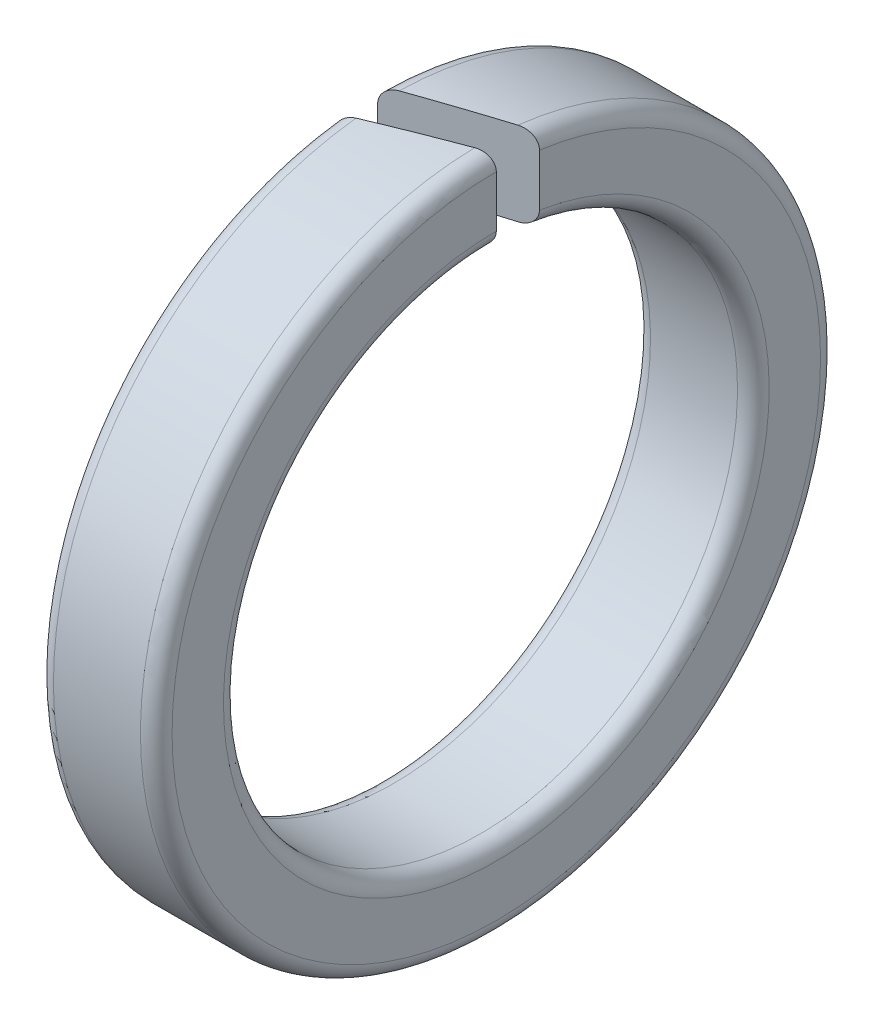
from build123d import *

# Parameters (mm, degrees)
ESQUISSE1_W             = 1.5
ESQUISSE1_H             = 1.05
ENL_V_MAT_EXTRU_1_DEPTH = 7.263385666
CONG_1_R                = 0.2


with BuildPart() as part:
    # Esquisse1 → Base-R_volution (revolve)
    with BuildSketch(Plane(origin=(0, 0, 0), x_dir=(1, 0, 0), z_dir=(0, 1, 0)), mode=Mode.PRIVATE) as base_r_volution_sk:
        with Locations((0.75, 3.775)):
            Rectangle(ESQUISSE1_W, ESQUISSE1_H)
    revolve(base_r_volution_sk.sketch.rotate(Axis((0, 0, 0), (1, 0, 0)), 180), axis=Axis((0, 0, 0), (1, 0, 0)))

    # Esquisse2 → Enl_v. mat.-Extru.1 (cut, through all)
    with BuildSketch(Plane(origin=(0, 0, 0), x_dir=(1, 0, 0), z_dir=(0, 1, 0))):
        Polygon((0, 0), (1.5, 0.545955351), (1.5, 0), (0, -0.545955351), align=None)
    extrude(amount=ENL_V_MAT_EXTRU_1_DEPTH, mode=Mode.SUBTRACT)

    # Cong_1
    cong_1_edges = [part.edges().sort_by_distance(p)[0] for p in [
        (1.5, -3.22781722, -2.840985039),
        (0, -3.040559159, -3.040559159),
        (1.5, -2.483631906, -2.096204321),
        (0, -2.298097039, -2.298097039),
    ]]
    fillet(cong_1_edges, radius=CONG_1_R)


solid = part.part
